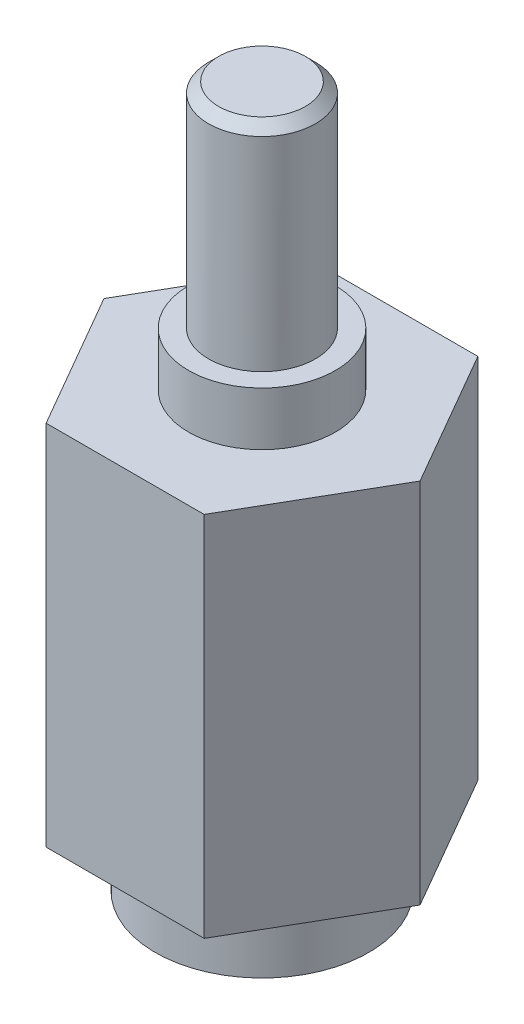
from build123d import *

# Parameters (mm, degrees)
TROU_TARAUD_M16X1_52_D     = 14.5
TROU_TARAUD_M16X1_52_DEPTH = 39.5
TROU_TARAUD_M16X1_52_TIP   = 4.356239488
EXTRUSION1_DEPTH           = 55
CHANFREIN1_SIZE            = 1.5


with BuildPart() as part:
    # Esquisse1 → R_volution4 (revolve)
    with BuildSketch(Plane.XY, mode=Mode.PRIVATE) as r_volution4_sk:
        Polygon((0, 0), (16, 0), (16, 10), (20, 10), (20, 65), (11, 65), (11, 73), (8, 73), (8, 105), (0, 105), align=None)
    revolve(r_volution4_sk.sketch.rotate(Axis((0, 105, 0), (0, -1, 0)), 180), axis=Axis((0, 105, 0), (0, -1, 0)))

    # Trou taraud_ M16x1.52
    with Locations(Plane.XZ):
        with Locations((0, 0)):
            Hole(TROU_TARAUD_M16X1_52_D / 2, depth=TROU_TARAUD_M16X1_52_DEPTH)
            with Locations((0, 0, -(TROU_TARAUD_M16X1_52_DEPTH + TROU_TARAUD_M16X1_52_TIP / 2))):  # 118° drill point
                Cone(0, TROU_TARAUD_M16X1_52_D / 2, TROU_TARAUD_M16X1_52_TIP, mode=Mode.SUBTRACT)

    # Esquisse7 → Extrusion1 (add)
    with BuildSketch(Plane(origin=(0, 65, 0), x_dir=(1, 0, 0), z_dir=(0, 1, 0))):
        Polygon((-11.835679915, 20.5), (11.835679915, 20.5), (23.67136164, 0), (11.835679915, -20.5), (-11.835679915, -20.5), (-23.67136164, 0), align=None)
    extrude(amount=-EXTRUSION1_DEPTH)

    # Chanfrein1
    chanfrein1_edges = [part.edges().sort_by_distance(p)[0] for p in [
        (8, 105, 0),
    ]]
    chamfer(chanfrein1_edges, length=CHANFREIN1_SIZE)


solid = part.part
